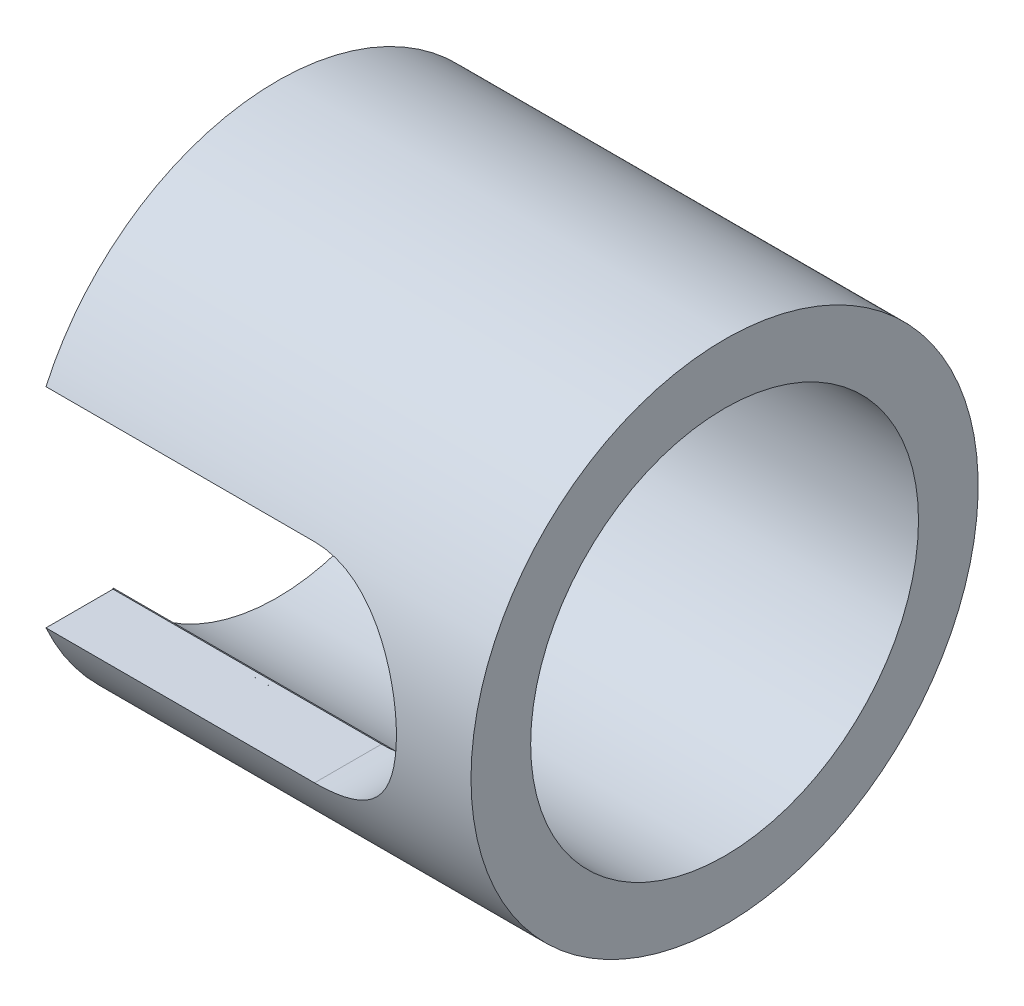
ISO-10303-21;
HEADER;
FILE_DESCRIPTION(('STEP AP214'),'2;1');
FILE_NAME('part.step','',(''),(''),'','','');
FILE_SCHEMA(('AUTOMOTIVE_DESIGN { 1 0 10303 214 1 1 1 1 }'));
ENDSEC;
DATA;
#1=APPLICATION_CONTEXT('core data for automotive mechanical design processes');
#2=APPLICATION_PROTOCOL_DEFINITION('international standard','automotive_design',2000,#1);
#3=PRODUCT_CONTEXT('',#1,'mechanical');
#4=PRODUCT('Part','Part','',(#3));
#5=PRODUCT_RELATED_PRODUCT_CATEGORY('part','',(#4));
#6=PRODUCT_DEFINITION_FORMATION('','',#4);
#7=PRODUCT_DEFINITION_CONTEXT('part definition',#1,'design');
#8=PRODUCT_DEFINITION('design','',#6,#7);
#9=PRODUCT_DEFINITION_SHAPE('','',#8);
#10=(LENGTH_UNIT() NAMED_UNIT(*) SI_UNIT(.MILLI.,.METRE.));
#11=(NAMED_UNIT(*) PLANE_ANGLE_UNIT() SI_UNIT($,.RADIAN.));
#12=(NAMED_UNIT(*) SI_UNIT($,.STERADIAN.) SOLID_ANGLE_UNIT());
#13=UNCERTAINTY_MEASURE_WITH_UNIT(LENGTH_MEASURE(1.E-05),#10,'distance_accuracy_value','');
#14=(GEOMETRIC_REPRESENTATION_CONTEXT(3) GLOBAL_UNCERTAINTY_ASSIGNED_CONTEXT((#13)) GLOBAL_UNIT_ASSIGNED_CONTEXT((#10,
#11,#12)) REPRESENTATION_CONTEXT('',''));
#15=CARTESIAN_POINT('',(0.,0.,0.));
#16=DIRECTION('',(0.,0.,1.));
#17=DIRECTION('',(1.,0.,0.));
#18=AXIS2_PLACEMENT_3D('',#15,#16,#17);
#19=CARTESIAN_POINT('',(-100.,7.5,0.));
#20=DIRECTION('',(-1.,0.,0.));
#21=DIRECTION('',(0.,0.,1.));
#22=AXIS2_PLACEMENT_3D('',#19,#20,#21);
#23=CYLINDRICAL_SURFACE('',#22,6.5);
#24=CARTESIAN_POINT('',(-45.,7.5,0.));
#25=DIRECTION('',(-1.,0.,0.));
#26=DIRECTION('',(0.,0.,1.));
#27=AXIS2_PLACEMENT_3D('',#24,#25,#26);
#28=CIRCLE('',#27,6.5);
#29=CARTESIAN_POINT('',(-45.,7.5,6.5));
#30=VERTEX_POINT('',#29);
#31=EDGE_CURVE('E160',#30,#30,#28,.T.);
#32=ORIENTED_EDGE('',*,*,#31,.F.);
#33=EDGE_LOOP('',(#32));
#34=FACE_BOUND('',#33,.T.);
#35=DIRECTION('',(-1.,0.,0.));
#36=VECTOR('',#35,1.);
#37=CARTESIAN_POINT('',(-100.,10.9641016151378,5.5));
#38=LINE('',#37,#36);
#39=CARTESIAN_POINT('',(-60.,10.9641016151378,5.5));
#40=VERTEX_POINT('',#39);
#41=CARTESIAN_POINT('',(-50.5,10.9641016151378,5.5));
#42=VERTEX_POINT('',#41);
#43=EDGE_CURVE('E162',#40,#42,#38,.F.);
#44=ORIENTED_EDGE('',*,*,#43,.F.);
#45=CARTESIAN_POINT('',(-60.,7.5,0.));
#46=DIRECTION('',(-1.,0.,0.));
#47=DIRECTION('',(0.,0.,1.));
#48=AXIS2_PLACEMENT_3D('',#45,#46,#47);
#49=CIRCLE('',#48,6.5);
#50=CARTESIAN_POINT('',(-60.,4.03589838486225,5.5));
#51=VERTEX_POINT('',#50);
#52=EDGE_CURVE('E143',#40,#51,#49,.T.);
#53=ORIENTED_EDGE('',*,*,#52,.T.);
#54=DIRECTION('',(-1.,0.,0.));
#55=VECTOR('',#54,1.);
#56=CARTESIAN_POINT('',(-100.,4.03589838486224,5.5));
#57=LINE('',#56,#55);
#58=CARTESIAN_POINT('',(-50.5,4.03589838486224,5.5));
#59=VERTEX_POINT('',#58);
#60=EDGE_CURVE('E57',#59,#51,#57,.T.);
#61=ORIENTED_EDGE('',*,*,#60,.F.);
#62=CARTESIAN_POINT('',(-50.5,4.03589838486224,5.5));
#63=CARTESIAN_POINT('',(-50.4051515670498,4.04957439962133,5.50859734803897));
#64=CARTESIAN_POINT('',(-50.3111229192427,4.06713609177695,5.51960365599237));
#65=CARTESIAN_POINT('',(-50.1254603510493,4.10968809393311,5.54585032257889));
#66=CARTESIAN_POINT('',(-50.0338241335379,4.13467096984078,5.56108644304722));
#67=CARTESIAN_POINT('',(-49.8540013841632,4.19159550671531,5.59513518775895));
#68=CARTESIAN_POINT('',(-49.7657987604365,4.2234984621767,5.6139278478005));
#69=CARTESIAN_POINT('',(-49.5928146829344,4.29398064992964,5.65447589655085));
#70=CARTESIAN_POINT('',(-49.5080340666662,4.33256150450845,5.6762320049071));
#71=CARTESIAN_POINT('',(-49.2600955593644,4.45749081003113,5.74474713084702));
#72=CARTESIAN_POINT('',(-49.1025247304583,4.55328822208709,5.79491827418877));
#73=CARTESIAN_POINT('',(-48.8049215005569,4.76771503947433,5.89905436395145));
#74=CARTESIAN_POINT('',(-48.6649222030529,4.88638650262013,5.95302618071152));
#75=CARTESIAN_POINT('',(-48.3921109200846,5.15706239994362,6.06499311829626));
#76=CARTESIAN_POINT('',(-48.261346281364,5.31119328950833,6.12286447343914));
#77=CARTESIAN_POINT('',(-48.0272765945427,5.64156426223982,6.23107533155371));
#78=CARTESIAN_POINT('',(-47.9239603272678,5.81779526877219,6.28141790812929));
#79=CARTESIAN_POINT('',(-47.7932166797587,6.09402774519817,6.34681738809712));
#80=CARTESIAN_POINT('',(-47.7538703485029,6.18737981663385,6.36682396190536));
#81=CARTESIAN_POINT('',(-47.6832420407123,6.37776777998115,6.40312097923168));
#82=CARTESIAN_POINT('',(-47.6519560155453,6.47480179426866,6.41941328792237));
#83=CARTESIAN_POINT('',(-47.5978785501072,6.6717509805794,6.44778273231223));
#84=CARTESIAN_POINT('',(-47.5750824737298,6.77166454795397,6.45986216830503));
#85=CARTESIAN_POINT('',(-47.5383007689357,6.97354079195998,6.47943805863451));
#86=CARTESIAN_POINT('',(-47.5243139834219,7.07550319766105,6.48693511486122));
#87=CARTESIAN_POINT('',(-47.5064616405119,7.2687143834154,6.49651924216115));
#88=CARTESIAN_POINT('',(-47.5016179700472,7.35984834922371,6.49912885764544));
#89=CARTESIAN_POINT('',(-47.4990663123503,7.54227680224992,6.50050269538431));
#90=CARTESIAN_POINT('',(-47.5013606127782,7.63357133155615,6.49926568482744));
#91=CARTESIAN_POINT('',(-47.5130604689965,7.81552463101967,6.4929748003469));
#92=CARTESIAN_POINT('',(-47.5224621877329,7.90618371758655,6.48792298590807));
#93=CARTESIAN_POINT('',(-47.5482440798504,8.08623170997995,6.47414134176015));
#94=CARTESIAN_POINT('',(-47.5646268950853,8.1756201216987,6.46541011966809));
#95=CARTESIAN_POINT('',(-47.6221991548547,8.43291413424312,6.43494130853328));
#96=CARTESIAN_POINT('',(-47.6724026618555,8.59835969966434,6.40859442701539));
#97=CARTESIAN_POINT('',(-47.7956205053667,8.91824091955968,6.34549203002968));
#98=CARTESIAN_POINT('',(-47.8686378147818,9.0726751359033,6.30873515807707));
#99=CARTESIAN_POINT('',(-48.0413734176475,9.37872900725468,6.22473735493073));
#100=CARTESIAN_POINT('',(-48.142661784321,9.52930428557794,6.1769237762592));
#101=CARTESIAN_POINT('',(-48.3663699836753,9.81227008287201,6.07667700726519));
#102=CARTESIAN_POINT('',(-48.4888136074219,9.94463982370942,6.02423864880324));
#103=CARTESIAN_POINT('',(-48.7672714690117,10.2027552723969,5.91328795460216));
#104=CARTESIAN_POINT('',(-48.9255089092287,10.3261031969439,5.85475240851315));
#105=CARTESIAN_POINT('',(-49.2620797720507,10.5446310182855,5.74414752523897));
#106=CARTESIAN_POINT('',(-49.4403740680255,10.6398644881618,5.69206600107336));
#107=CARTESIAN_POINT('',(-49.7647120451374,10.7781799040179,5.61321010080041));
#108=CARTESIAN_POINT('',(-49.9069717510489,10.8283881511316,5.58338016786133));
#109=CARTESIAN_POINT('',(-50.1256704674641,10.8898838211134,5.54610318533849));
#110=CARTESIAN_POINT('',(-50.1995713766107,10.9080967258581,5.53491086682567));
#111=CARTESIAN_POINT('',(-50.3488047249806,10.9397341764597,5.51530234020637));
#112=CARTESIAN_POINT('',(-50.4241381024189,10.9531554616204,5.50688802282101));
#113=CARTESIAN_POINT('',(-50.5,10.9641016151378,5.5));
#114=B_SPLINE_CURVE_WITH_KNOTS('',3,(#62,#63,#64,#65,#66,#67,#68,#69,#70,#71,#72,#73,#74,#75,
#76,#77,#78,#79,#80,#81,#82,#83,#84,#85,#86,#87,#88,#89,#90,#91,#92,#93,#94,#95,#96,#97,#98,#99,
#100,#101,#102,#103,#104,#105,#106,#107,#108,#109,#110,#111,#112,#113),.UNSPECIFIED.,.F.,.F.,(4,
2,2,2,2,2,2,2,2,2,2,2,2,2,2,2,2,2,2,2,2,2,2,2,2,4),(0.,0.288471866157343,0.576655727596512,
0.863267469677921,1.14994893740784,1.72072377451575,2.29255826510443,2.92040671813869,
3.54799814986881,3.8574143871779,4.16667490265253,4.47576629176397,4.78481707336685,
5.05836518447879,5.33200097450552,5.6054891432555,5.87908090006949,6.4012770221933,
6.92354122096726,7.48425757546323,8.04560866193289,8.66976055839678,9.29271531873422,
9.75250886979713,9.98310827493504,10.2138643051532),.UNSPECIFIED.);
#115=EDGE_CURVE('E116',#59,#42,#114,.T.);
#116=ORIENTED_EDGE('',*,*,#115,.T.);
#117=EDGE_LOOP('',(#44,#53,#61,#116));
#118=FACE_BOUND('',#117,.T.);
#119=ADVANCED_FACE('F34',(#34,#118),#23,.F.);
#120=CARTESIAN_POINT('',(-60.,14.,0.));
#121=DIRECTION('',(1.,0.,0.));
#122=DIRECTION('',(0.,0.,-1.));
#123=AXIS2_PLACEMENT_3D('',#120,#121,#122);
#124=PLANE('',#123);
#125=DIRECTION('',(0.,-1.,0.));
#126=VECTOR('',#125,1.);
#127=CARTESIAN_POINT('',(-60.,11.,5.5));
#128=LINE('',#127,#126);
#129=CARTESIAN_POINT('',(-60.,11.,5.5));
#130=VERTEX_POINT('',#129);
#131=EDGE_CURVE('E93',#130,#40,#128,.T.);
#132=ORIENTED_EDGE('',*,*,#131,.F.);
#133=DIRECTION('',(0.,0.,1.));
#134=VECTOR('',#133,1.);
#135=CARTESIAN_POINT('',(-60.,11.,5.5));
#136=LINE('',#135,#134);
#137=CARTESIAN_POINT('',(-60.,11.,7.74596669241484));
#138=VERTEX_POINT('',#137);
#139=EDGE_CURVE('E123',#130,#138,#136,.T.);
#140=ORIENTED_EDGE('',*,*,#139,.T.);
#141=CARTESIAN_POINT('',(-60.,7.5,0.));
#142=DIRECTION('',(-1.,0.,0.));
#143=DIRECTION('',(0.,0.,1.));
#144=AXIS2_PLACEMENT_3D('',#141,#142,#143);
#145=CIRCLE('',#144,8.5);
#146=CARTESIAN_POINT('',(-60.,3.99999999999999,7.74596669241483));
#147=VERTEX_POINT('',#146);
#148=EDGE_CURVE('E106',#138,#147,#145,.T.);
#149=ORIENTED_EDGE('',*,*,#148,.T.);
#150=DIRECTION('',(0.,0.,1.));
#151=VECTOR('',#150,1.);
#152=CARTESIAN_POINT('',(-60.,4.,5.5));
#153=LINE('',#152,#151);
#154=CARTESIAN_POINT('',(-60.,4.,5.5));
#155=VERTEX_POINT('',#154);
#156=EDGE_CURVE('E49',#155,#147,#153,.T.);
#157=ORIENTED_EDGE('',*,*,#156,.F.);
#158=EDGE_CURVE('E87',#51,#155,#128,.T.);
#159=ORIENTED_EDGE('',*,*,#158,.F.);
#160=ORIENTED_EDGE('',*,*,#52,.F.);
#161=EDGE_LOOP('',(#132,#140,#149,#157,#159,#160));
#162=FACE_BOUND('',#161,.T.);
#163=ADVANCED_FACE('F103',(#162),#124,.F.);
#164=CARTESIAN_POINT('',(-100.,7.5,0.));
#165=DIRECTION('',(-1.,0.,0.));
#166=DIRECTION('',(0.,0.,1.));
#167=AXIS2_PLACEMENT_3D('',#164,#165,#166);
#168=CYLINDRICAL_SURFACE('',#167,8.5);
#169=ORIENTED_EDGE('',*,*,#148,.F.);
#170=DIRECTION('',(-1.,0.,0.));
#171=VECTOR('',#170,1.);
#172=CARTESIAN_POINT('',(-100.,11.,7.74596669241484));
#173=LINE('',#172,#171);
#174=CARTESIAN_POINT('',(-51.,11.,7.74596669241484));
#175=VERTEX_POINT('',#174);
#176=EDGE_CURVE('E11',#138,#175,#173,.F.);
#177=ORIENTED_EDGE('',*,*,#176,.T.);
#178=CARTESIAN_POINT('',(-51.,11.,7.74596669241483));
#179=CARTESIAN_POINT('',(-50.9061017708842,11.0000142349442,7.74594655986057));
#180=CARTESIAN_POINT('',(-50.8122145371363,10.9962217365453,7.74767358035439));
#181=CARTESIAN_POINT('',(-50.625203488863,10.9811346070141,7.75447138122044));
#182=CARTESIAN_POINT('',(-50.5320793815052,10.9698430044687,7.75954081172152));
#183=CARTESIAN_POINT('',(-50.3476397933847,10.9399305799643,7.77284564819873));
#184=CARTESIAN_POINT('',(-50.2563184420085,10.9213401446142,7.78106792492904));
#185=CARTESIAN_POINT('',(-50.0757510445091,10.8770425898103,7.80039517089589));
#186=CARTESIAN_POINT('',(-49.9865051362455,10.8513349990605,7.81150033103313));
#187=CARTESIAN_POINT('',(-49.7229890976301,10.7639533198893,7.84860813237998));
#188=CARTESIAN_POINT('',(-49.5525546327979,10.6919567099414,7.87843322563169));
#189=CARTESIAN_POINT('',(-49.22610395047,10.5227805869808,7.94487364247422));
#190=CARTESIAN_POINT('',(-49.0701025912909,10.4255755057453,7.98149584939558));
#191=CARTESIAN_POINT('',(-48.7675932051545,10.2025076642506,8.05984812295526));
#192=CARTESIAN_POINT('',(-48.6220656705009,10.0753719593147,8.10174777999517));
#193=CARTESIAN_POINT('',(-48.3536977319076,9.79874812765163,8.18453336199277));
#194=CARTESIAN_POINT('',(-48.2308621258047,9.64925528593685,8.22541907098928));
#195=CARTESIAN_POINT('',(-48.006302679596,9.32438221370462,8.30365377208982));
#196=CARTESIAN_POINT('',(-47.9056908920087,9.14817475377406,8.34078017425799));
#197=CARTESIAN_POINT('',(-47.735965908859,8.77953284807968,8.4052201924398));
#198=CARTESIAN_POINT('',(-47.6668388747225,8.58710557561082,8.4325381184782));
#199=CARTESIAN_POINT('',(-47.5656203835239,8.20188880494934,8.47307047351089));
#200=CARTESIAN_POINT('',(-47.5318208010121,8.00961769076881,8.48693279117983));
#201=CARTESIAN_POINT('',(-47.4967027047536,7.62166316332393,8.50134212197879));
#202=CARTESIAN_POINT('',(-47.4953719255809,7.42598106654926,8.50189416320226));
#203=CARTESIAN_POINT('',(-47.5243234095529,7.04915995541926,8.49000535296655));
#204=CARTESIAN_POINT('',(-47.5527306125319,6.86784805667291,8.47833512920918));
#205=CARTESIAN_POINT('',(-47.6371438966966,6.51283393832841,8.44436587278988));
#206=CARTESIAN_POINT('',(-47.6931515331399,6.33913214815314,8.4220662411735));
#207=CARTESIAN_POINT('',(-47.8318502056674,6.00109238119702,8.36857406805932));
#208=CARTESIAN_POINT('',(-47.9149343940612,5.83693716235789,8.33725134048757));
#209=CARTESIAN_POINT('',(-48.1050458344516,5.52446921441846,8.26879082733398));
#210=CARTESIAN_POINT('',(-48.2120817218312,5.3761622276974,8.2316509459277));
#211=CARTESIAN_POINT('',(-48.4556631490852,5.08872906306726,8.15227071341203));
#212=CARTESIAN_POINT('',(-48.5937351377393,4.95094221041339,8.10985525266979));
#213=CARTESIAN_POINT('',(-48.8911237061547,4.69989894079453,8.02664063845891));
#214=CARTESIAN_POINT('',(-49.0504506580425,4.5866545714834,7.9858422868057));
#215=CARTESIAN_POINT('',(-49.3924190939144,4.38450998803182,7.90922482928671));
#216=CARTESIAN_POINT('',(-49.5756432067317,4.29650406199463,7.8736066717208));
#217=CARTESIAN_POINT('',(-49.860694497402,4.18905956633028,7.82873926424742));
#218=CARTESIAN_POINT('',(-49.9573868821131,4.15734400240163,7.8152125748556));
#219=CARTESIAN_POINT('',(-50.1535314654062,4.10237629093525,7.79147283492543));
#220=CARTESIAN_POINT('',(-50.2529824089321,4.07912036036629,7.78125830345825));
#221=CARTESIAN_POINT('',(-50.4597250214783,4.04026102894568,7.76406550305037));
#222=CARTESIAN_POINT('',(-50.5671349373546,4.02518513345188,7.75731161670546));
#223=CARTESIAN_POINT('',(-50.7830244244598,4.00504391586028,7.74824522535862));
#224=CARTESIAN_POINT('',(-50.8915035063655,3.99997421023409,7.74593077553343));
#225=CARTESIAN_POINT('',(-51.,4.,7.74596669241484));
#226=B_SPLINE_CURVE_WITH_KNOTS('',3,(#178,#179,#180,#181,#182,#183,#184,#185,#186,#187,#188,
#189,#190,#191,#192,#193,#194,#195,#196,#197,#198,#199,#200,#201,#202,#203,#204,#205,#206,#207,
#208,#209,#210,#211,#212,#213,#214,#215,#216,#217,#218,#219,#220,#221,#222,#223,#224,#225),
.UNSPECIFIED.,.F.,.F.,(4,2,2,2,2,2,2,2,2,2,2,2,2,2,2,2,2,2,2,2,2,2,2,4),(0.,0.281583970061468,
0.563054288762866,0.843365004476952,1.12369428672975,1.68319049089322,2.24325641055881,
2.83384048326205,3.42454928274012,4.04023074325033,4.65564132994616,5.23968423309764,
5.82350650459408,6.37261370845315,6.92175185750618,7.47924800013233,8.03694546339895,
8.63311953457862,9.22958560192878,9.84512560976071,10.1527310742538,10.460198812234,
10.7856606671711,11.1109799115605),.UNSPECIFIED.);
#227=CARTESIAN_POINT('',(-51.,4.,7.74596669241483));
#228=VERTEX_POINT('',#227);
#229=EDGE_CURVE('E136',#175,#228,#226,.T.);
#230=ORIENTED_EDGE('',*,*,#229,.T.);
#231=DIRECTION('',(-1.,0.,0.));
#232=VECTOR('',#231,1.);
#233=CARTESIAN_POINT('',(-100.,3.99999999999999,7.74596669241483));
#234=LINE('',#233,#232);
#235=EDGE_CURVE('E42',#228,#147,#234,.T.);
#236=ORIENTED_EDGE('',*,*,#235,.T.);
#237=EDGE_LOOP('',(#169,#177,#230,#236));
#238=FACE_BOUND('',#237,.T.);
#239=CARTESIAN_POINT('',(-45.,7.5,0.));
#240=DIRECTION('',(-1.,0.,0.));
#241=DIRECTION('',(0.,0.,1.));
#242=AXIS2_PLACEMENT_3D('',#239,#240,#241);
#243=CIRCLE('',#242,8.5);
#244=CARTESIAN_POINT('',(-45.,7.5,8.5));
#245=VERTEX_POINT('',#244);
#246=EDGE_CURVE('E165',#245,#245,#243,.T.);
#247=ORIENTED_EDGE('',*,*,#246,.T.);
#248=EDGE_LOOP('',(#247));
#249=FACE_BOUND('',#248,.T.);
#250=ADVANCED_FACE('F145',(#238,#249),#168,.T.);
#251=CARTESIAN_POINT('',(-45.,16.,0.));
#252=DIRECTION('',(-1.,0.,0.));
#253=DIRECTION('',(0.,0.,1.));
#254=AXIS2_PLACEMENT_3D('',#251,#252,#253);
#255=PLANE('',#254);
#256=ORIENTED_EDGE('',*,*,#246,.F.);
#257=EDGE_LOOP('',(#256));
#258=FACE_BOUND('',#257,.T.);
#259=ORIENTED_EDGE('',*,*,#31,.T.);
#260=EDGE_LOOP('',(#259));
#261=FACE_BOUND('',#260,.T.);
#262=ADVANCED_FACE('F148',(#258,#261),#255,.F.);
#263=CARTESIAN_POINT('',(-51.,7.5,5.5));
#264=DIRECTION('',(0.,0.,1.));
#265=DIRECTION('',(1.,0.,0.));
#266=AXIS2_PLACEMENT_3D('',#263,#264,#265);
#267=PLANE('',#266);
#268=ORIENTED_EDGE('',*,*,#43,.T.);
#269=CARTESIAN_POINT('',(-51.,7.5,5.5));
#270=DIRECTION('',(0.,0.,1.));
#271=DIRECTION('',(1.,0.,0.));
#272=AXIS2_PLACEMENT_3D('',#269,#270,#271);
#273=CIRCLE('',#272,3.5);
#274=CARTESIAN_POINT('',(-51.,11.,5.5));
#275=VERTEX_POINT('',#274);
#276=EDGE_CURVE('E99',#42,#275,#273,.T.);
#277=ORIENTED_EDGE('',*,*,#276,.T.);
#278=DIRECTION('',(-1.,0.,0.));
#279=VECTOR('',#278,1.);
#280=CARTESIAN_POINT('',(-60.,11.,5.5));
#281=LINE('',#280,#279);
#282=EDGE_CURVE('E107',#275,#130,#281,.T.);
#283=ORIENTED_EDGE('',*,*,#282,.T.);
#284=ORIENTED_EDGE('',*,*,#131,.T.);
#285=EDGE_LOOP('',(#268,#277,#283,#284));
#286=FACE_BOUND('',#285,.T.);
#287=ADVANCED_FACE('F171',(#286),#267,.T.);
#288=ORIENTED_EDGE('',*,*,#60,.T.);
#289=ORIENTED_EDGE('',*,*,#158,.T.);
#290=DIRECTION('',(1.,0.,0.));
#291=VECTOR('',#290,1.);
#292=CARTESIAN_POINT('',(-60.,4.,5.5));
#293=LINE('',#292,#291);
#294=CARTESIAN_POINT('',(-51.,4.,5.5));
#295=VERTEX_POINT('',#294);
#296=EDGE_CURVE('E89',#155,#295,#293,.T.);
#297=ORIENTED_EDGE('',*,*,#296,.T.);
#298=EDGE_CURVE('E112',#295,#59,#273,.T.);
#299=ORIENTED_EDGE('',*,*,#298,.T.);
#300=EDGE_LOOP('',(#288,#289,#297,#299));
#301=FACE_BOUND('',#300,.T.);
#302=ADVANCED_FACE('F88',(#301),#267,.T.);
#303=CARTESIAN_POINT('',(-60.,11.,5.5));
#304=DIRECTION('',(0.,1.,0.));
#305=DIRECTION('',(0.,0.,1.));
#306=AXIS2_PLACEMENT_3D('',#303,#304,#305);
#307=PLANE('',#306);
#308=ORIENTED_EDGE('',*,*,#139,.F.);
#309=ORIENTED_EDGE('',*,*,#282,.F.);
#310=DIRECTION('',(0.,0.,1.));
#311=VECTOR('',#310,1.);
#312=CARTESIAN_POINT('',(-51.,11.,5.5));
#313=LINE('',#312,#311);
#314=EDGE_CURVE('E109',#275,#175,#313,.T.);
#315=ORIENTED_EDGE('',*,*,#314,.T.);
#316=ORIENTED_EDGE('',*,*,#176,.F.);
#317=EDGE_LOOP('',(#308,#309,#315,#316));
#318=FACE_BOUND('',#317,.T.);
#319=ADVANCED_FACE('F130',(#318),#307,.F.);
#320=CARTESIAN_POINT('',(-51.,7.5,5.5));
#321=DIRECTION('',(0.,0.,1.));
#322=DIRECTION('',(1.,0.,0.));
#323=AXIS2_PLACEMENT_3D('',#320,#321,#322);
#324=CYLINDRICAL_SURFACE('',#323,3.5);
#325=ORIENTED_EDGE('',*,*,#298,.F.);
#326=DIRECTION('',(0.,0.,1.));
#327=VECTOR('',#326,1.);
#328=CARTESIAN_POINT('',(-51.,4.,5.5));
#329=LINE('',#328,#327);
#330=EDGE_CURVE('E97',#295,#228,#329,.T.);
#331=ORIENTED_EDGE('',*,*,#330,.T.);
#332=ORIENTED_EDGE('',*,*,#229,.F.);
#333=ORIENTED_EDGE('',*,*,#314,.F.);
#334=ORIENTED_EDGE('',*,*,#276,.F.);
#335=ORIENTED_EDGE('',*,*,#115,.F.);
#336=EDGE_LOOP('',(#325,#331,#332,#333,#334,#335));
#337=FACE_BOUND('',#336,.T.);
#338=ADVANCED_FACE('F125',(#337),#324,.F.);
#339=CARTESIAN_POINT('',(-60.,4.,5.5));
#340=DIRECTION('',(0.,-1.,0.));
#341=DIRECTION('',(1.,0.,0.));
#342=AXIS2_PLACEMENT_3D('',#339,#340,#341);
#343=PLANE('',#342);
#344=ORIENTED_EDGE('',*,*,#330,.F.);
#345=ORIENTED_EDGE('',*,*,#296,.F.);
#346=ORIENTED_EDGE('',*,*,#156,.T.);
#347=ORIENTED_EDGE('',*,*,#235,.F.);
#348=EDGE_LOOP('',(#344,#345,#346,#347));
#349=FACE_BOUND('',#348,.T.);
#350=ADVANCED_FACE('F95',(#349),#343,.F.);
#351=CLOSED_SHELL('',(#119,#163,#250,#262,#287,#302,#319,#338,#350));
#352=MANIFOLD_SOLID_BREP('B2',#351);
#353=ADVANCED_BREP_SHAPE_REPRESENTATION('',(#18,#352),#14);
#354=SHAPE_DEFINITION_REPRESENTATION(#9,#353);
ENDSEC;
END-ISO-10303-21;
